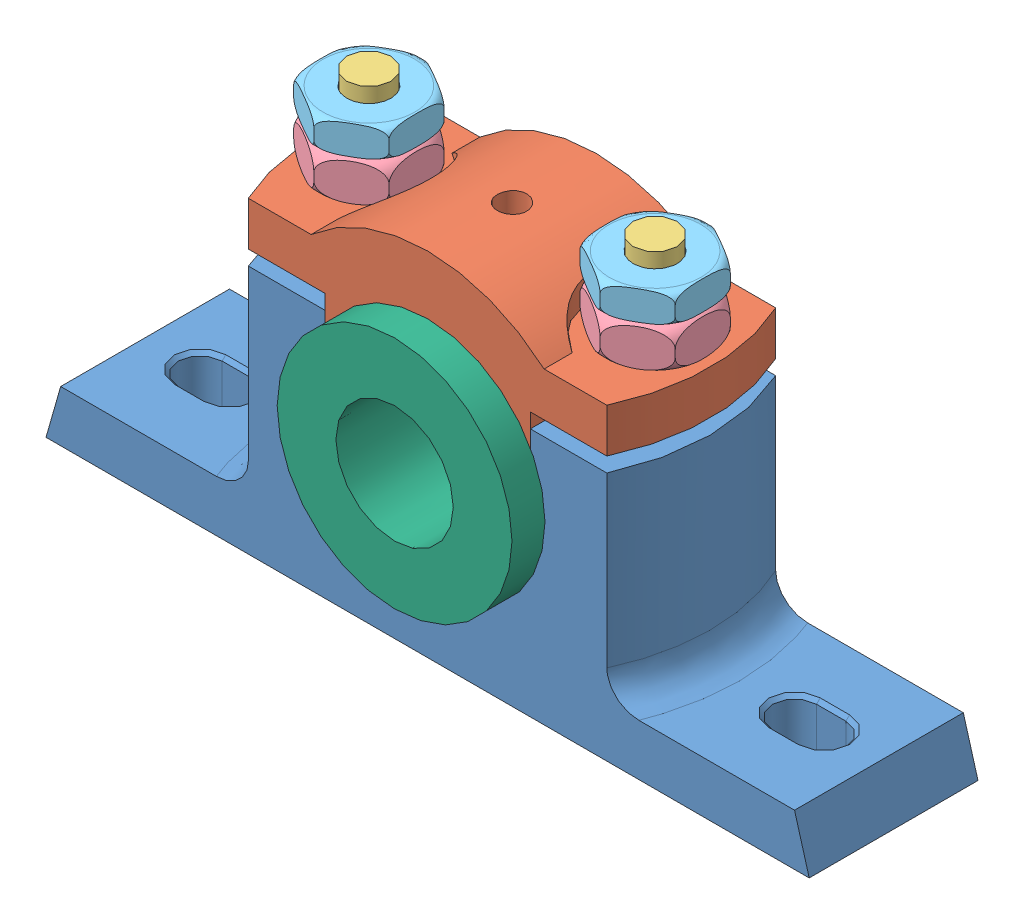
SolidWorks assembly plummer block.SLDASM, configuration Default (file format 3100). Lengths in mm.
Overall size (208 108 64).
9 component instances, 6 part files, 23 mates.
Components (placement in the parent):
- Casting-1: Casting.SLDPRT [Default] at origin size (208 68 46)
- Cap-1: Cap.SLDPRT [Default] at (0 48 0) size (108 40 46)
- Bolt-1: Bolt.SLDPRT [Default] at (-39 12 0) x (0 0 1) z (-1 0 0) size (26.18 105 26.18)
- Nut-1: Nut.SLDPRT [Default] at (39 84 0) x (0.866025 0 -0.5) z (0.5 0 0.866025) size (31.62 12 27.6)
- Lock nut-1: Lock nut.SLDPRT [Default] at (-39 100 0) x (0.866025 0 0.5) z (-0.5 0 0.866025) size (31.3 9.54 27.28)
- Brasses-1: Brasses.SLDPRT [Default] at (0 48 0) x (0 0 -1) z (1 0 0) size (64 64 64)
- Bolt-3: Bolt.SLDPRT [Default] at (39 12 0) x (-1 0 0) z (0 0 -1) size (26.18 105 26.18)
- Nut-2: Nut.SLDPRT [Default] at (-39 84 0) x (0.866025 0 0.5) z (-0.5 0 0.866025) size (31.62 12 27.6)
- Lock nut-2: Lock nut.SLDPRT [Default] at (39 100 0) x (0 0 -1) z (1 0 0) size (31.3 9.54 27.28)
Mates (geometry in assembly coordinates):
- Concentric1: concentric anti-aligned: cylinder of Casting-1; cylinder of Cap-1
- Concentric3: concentric anti-aligned: cylinder of Casting-1; cylinder of Brasses-1
- Concentric4: concentric aligned: cylinder of Casting-1; cylinder of Brasses-1
- Concentric5: concentric anti-aligned: cylinder of Casting-1; cylinder of Cap-1
- Concentric7: concentric anti-aligned: cylinder of Cap-1; cylinder of Brasses-1
- Concentric8: concentric anti-aligned: cylinder of Cap-1; cylinder of Bolt-1
- Coincident9: coincident anti-aligned: plane of Casting-1 through (-26 12 -13) normal (0 -1 0); plane of Bolt-1 through (-51 12 -12) normal (0 1 0)
- Concentric10: concentric anti-aligned: cylinder of Cap-1; cylinder of Bolt-3
- Parallel1: parallel anti-aligned: plane of Casting-1 through (26 12 13) normal (1 0 0); plane of Bolt-3 through (27 4 12) normal (-1 0 0)
- Coincident10: coincident anti-aligned: plane of Casting-1 through (26 12 -13) normal (0 -1 0); plane of Bolt-3 through (51 12 -12) normal (0 1 0)
- Parallel3: parallel anti-aligned: plane of Casting-1 through (-52 12 13) normal (1 0 0); plane of Bolt-1 through (-51 4 -12) normal (-1 0 0)
- Concentric11: concentric aligned: cylinder of Nut-1; cylinder of Bolt-3
- Coincident11: coincident anti-aligned: plane of Cap-1 through (54 84 23) normal (0 1 0); plane of Nut-1 through (51.9904 84 -22.5) normal (0 -1 0)
- Concentric12: concentric aligned: cylinder of Bolt-3; cylinder of Lock nut-2
- Coincident12: coincident anti-aligned: plane of Nut-1 through (51.9904 96 -22.5) normal (0 1 0); plane of Lock nut-2 through (26.0096 96 -22.5) normal (0 -1 0)
- Parallel4: parallel aligned: plane of Nut-1 through (51.9904 96 7.5) normal (1 0 0); plane of assembly
- Parallel5: parallel aligned: plane of Lock nut-2 through (51.9904 104 7.5) normal (1 0 0); plane of assembly
- Concentric13: concentric aligned: cylinder of Bolt-1; cylinder of Nut-2
- Coincident14: coincident anti-aligned: plane of Cap-1 through (-54 84 23) normal (0 1 0); plane of Nut-2 through (-13.0192 84 0) normal (0 -1 0)
- Concentric14: concentric aligned: cylinder of Bolt-1; cylinder of Lock nut-1
- Coincident15: coincident anti-aligned: plane of Lock nut-1 through (-13.0192 96 0) normal (0 -1 0); plane of Nut-2 through (-13.0192 96 0) normal (0 1 0)
- Parallel6: parallel anti-aligned: plane of Nut-2 through (-51.9904 96 -7.5) normal (-1 0 0); plane of assembly
- Parallel7: parallel anti-aligned: unknown of Lock nut-1
